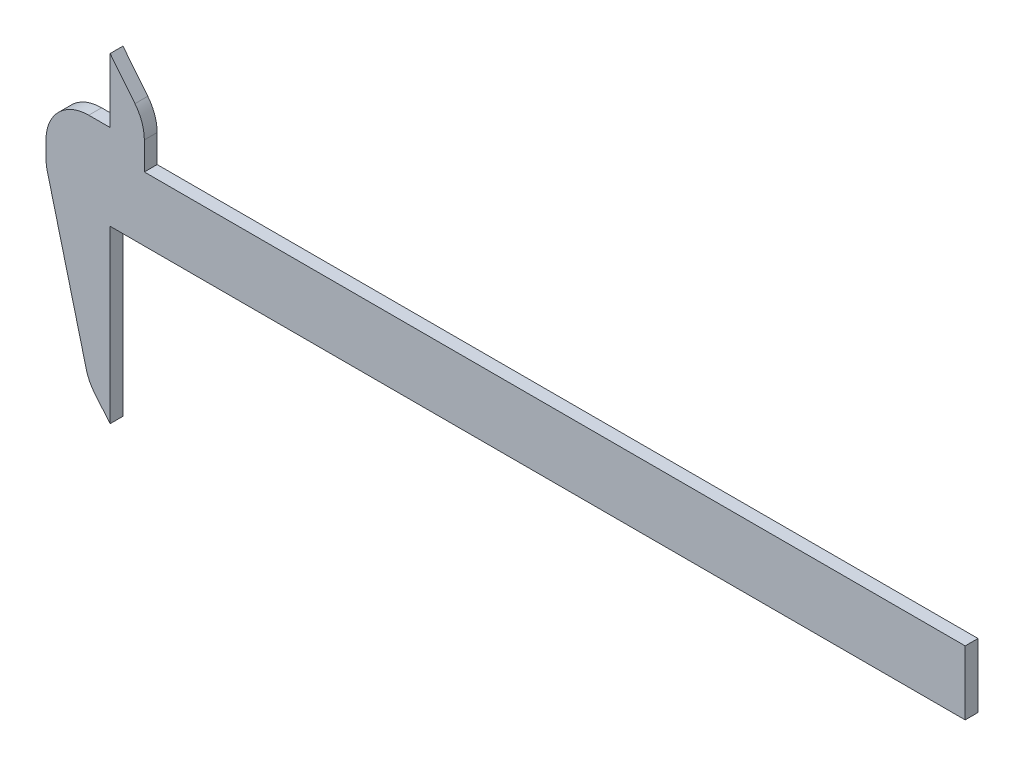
from build123d import *

# Parameters (mm, degrees)
BOSS_EXTRU_1_DEPTH = 3
CONG_1_R           = 10
CONG_2_R           = 10


with BuildPart() as part:
    # Esquisse1 → Boss.-Extru.1 (new body)
    with BuildSketch(Plane.XY):
        Polygon((0, 0), (200, 0), (200, 15), (8, 15), (8, 25), (0, 35), (0, 20), (-15, 20), (-15, 5), (-5, -34), (0, -40), align=None)
    extrude(amount=BOSS_EXTRU_1_DEPTH)

    # Cong_1
    cong_1_edges = [part.edges().sort_by_distance(p)[0] for p in [
        (-5, -34, 1.5),
        (-15, 5, 1.5),
        (-15, 20, 1.5),
    ]]
    fillet(cong_1_edges, radius=CONG_1_R)

    # Cong_2
    cong_2_edges = [part.edges().sort_by_distance(p)[0] for p in [
        (8, 25, 1.5),
    ]]
    fillet(cong_2_edges, radius=CONG_2_R)


solid = part.part
